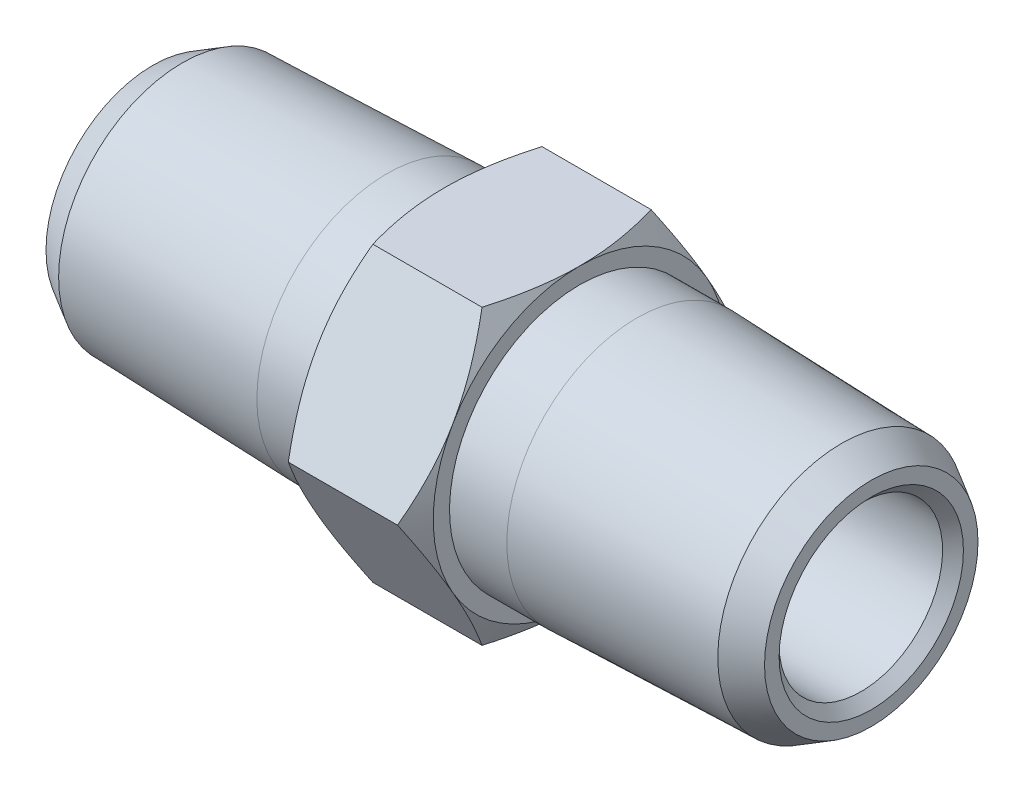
ISO-10303-21;
HEADER;
FILE_DESCRIPTION(('STEP AP214'),'2;1');
FILE_NAME('part.step','',(''),(''),'','','');
FILE_SCHEMA(('AUTOMOTIVE_DESIGN { 1 0 10303 214 1 1 1 1 }'));
ENDSEC;
DATA;
#1=APPLICATION_CONTEXT('core data for automotive mechanical design processes');
#2=APPLICATION_PROTOCOL_DEFINITION('international standard','automotive_design',2000,#1);
#3=PRODUCT_CONTEXT('',#1,'mechanical');
#4=PRODUCT('Part','Part','',(#3));
#5=PRODUCT_RELATED_PRODUCT_CATEGORY('part','',(#4));
#6=PRODUCT_DEFINITION_FORMATION('','',#4);
#7=PRODUCT_DEFINITION_CONTEXT('part definition',#1,'design');
#8=PRODUCT_DEFINITION('design','',#6,#7);
#9=PRODUCT_DEFINITION_SHAPE('','',#8);
#10=(LENGTH_UNIT() NAMED_UNIT(*) SI_UNIT(.MILLI.,.METRE.));
#11=(NAMED_UNIT(*) PLANE_ANGLE_UNIT() SI_UNIT($,.RADIAN.));
#12=(NAMED_UNIT(*) SI_UNIT($,.STERADIAN.) SOLID_ANGLE_UNIT());
#13=UNCERTAINTY_MEASURE_WITH_UNIT(LENGTH_MEASURE(1.E-05),#10,'distance_accuracy_value','');
#14=(GEOMETRIC_REPRESENTATION_CONTEXT(3) GLOBAL_UNCERTAINTY_ASSIGNED_CONTEXT((#13)) GLOBAL_UNIT_ASSIGNED_CONTEXT((#10,
#11,#12)) REPRESENTATION_CONTEXT('',''));
#15=CARTESIAN_POINT('',(0.,0.,0.));
#16=DIRECTION('',(0.,0.,1.));
#17=DIRECTION('',(1.,0.,0.));
#18=AXIS2_PLACEMENT_3D('',#15,#16,#17);
#19=CARTESIAN_POINT('',(0.,0.,-8.24889197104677));
#20=DIRECTION('',(0.,-0.5,-0.866025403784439));
#21=DIRECTION('',(0.,0.866025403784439,-0.5));
#22=AXIS2_PLACEMENT_3D('',#19,#20,#21);
#23=PLANE('',#22);
#24=CARTESIAN_POINT('',(-2.66394599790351,-2.19142867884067E-08,-8.24889195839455));
#25=CARTESIAN_POINT('',(-2.76088667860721,-0.290749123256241,-8.08102788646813));
#26=CARTESIAN_POINT('',(-2.84970126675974,-0.583826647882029,-7.911819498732));
#27=CARTESIAN_POINT('',(-3.00632419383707,-1.17256514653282,-7.57191116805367));
#28=CARTESIAN_POINT('',(-3.07423640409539,-1.46820558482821,-7.40122308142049));
#29=CARTESIAN_POINT('',(-3.15762106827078,-1.91445637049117,-7.1435800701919));
#30=CARTESIAN_POINT('',(-3.18234547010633,-2.06377034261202,-7.05737360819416));
#31=CARTESIAN_POINT('',(-3.22514392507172,-2.36311311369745,-6.88454797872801));
#32=CARTESIAN_POINT('',(-3.24321815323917,-2.51314189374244,-6.79792882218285));
#33=CARTESIAN_POINT('',(-3.27239869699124,-2.81446921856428,-6.62395741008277));
#34=CARTESIAN_POINT('',(-3.28346957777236,-2.96577035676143,-6.53660365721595));
#35=CARTESIAN_POINT('',(-3.29828555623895,-3.26867019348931,-6.36172435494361));
#36=CARTESIAN_POINT('',(-3.30202920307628,-3.42026894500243,-6.2741987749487));
#37=CARTESIAN_POINT('',(-3.30200000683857,-3.57187499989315,-6.18666897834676));
#38=B_SPLINE_CURVE_WITH_KNOTS('',3,(#24,#25,#26,#27,#28,#29,#30,#31,#32,#33,#34,#35,#36,#37),
.UNSPECIFIED.,.F.,.F.,(4,2,2,2,2,2,4),(0.,1.0487548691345,2.09221066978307,2.61462318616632,
3.1370219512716,3.66204318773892,4.18716837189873),.UNSPECIFIED.);
#39=CARTESIAN_POINT('',(-2.66394599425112,1.0957143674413E-08,-8.24889196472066));
#40=VERTEX_POINT('',#39);
#41=CARTESIAN_POINT('',(-3.30200000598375,-3.5718750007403,-6.1866689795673));
#42=VERTEX_POINT('',#41);
#43=EDGE_CURVE('E289',#40,#42,#38,.T.);
#44=ORIENTED_EDGE('',*,*,#43,.F.);
#45=DIRECTION('',(1.,0.,0.));
#46=VECTOR('',#45,1.);
#47=CARTESIAN_POINT('',(0.,0.,-8.24889197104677));
#48=LINE('',#47,#46);
#49=CARTESIAN_POINT('',(2.66394598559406,1.5014070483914E-08,-8.24889197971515));
#50=VERTEX_POINT('',#49);
#51=EDGE_CURVE('E134',#50,#40,#48,.F.);
#52=ORIENTED_EDGE('',*,*,#51,.F.);
#53=CARTESIAN_POINT('',(3.30200000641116,-3.57187499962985,-6.18666897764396));
#54=CARTESIAN_POINT('',(3.30202920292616,-3.42026894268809,-6.27419877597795));
#55=CARTESIAN_POINT('',(3.29828555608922,-3.26867018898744,-6.36172435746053));
#56=CARTESIAN_POINT('',(3.28346957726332,-2.96577034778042,-6.53660366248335));
#57=CARTESIAN_POINT('',(3.27239869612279,-2.81446920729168,-6.62395741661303));
#58=CARTESIAN_POINT('',(3.24321815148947,-2.51314187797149,-6.7979288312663));
#59=CARTESIAN_POINT('',(3.22514392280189,-2.3631130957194,-6.88454798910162));
#60=CARTESIAN_POINT('',(3.18234546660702,-2.06377032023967,-7.05737362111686));
#61=CARTESIAN_POINT('',(3.15762106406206,-1.91445634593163,-7.14358008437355));
#62=CARTESIAN_POINT('',(3.07423639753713,-1.46820555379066,-7.40122309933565));
#63=CARTESIAN_POINT('',(3.00632418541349,-1.17256511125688,-7.57191118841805));
#64=CARTESIAN_POINT('',(2.8497012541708,-0.583826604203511,-7.91181952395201));
#65=CARTESIAN_POINT('',(2.76088666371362,-0.290749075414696,-8.08102791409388));
#66=CARTESIAN_POINT('',(2.66394598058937,3.00281405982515E-08,-8.24889198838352));
#67=B_SPLINE_CURVE_WITH_KNOTS('',3,(#53,#54,#55,#56,#57,#58,#59,#60,#61,#62,#63,#64,#65,#66),
.UNSPECIFIED.,.F.,.F.,(4,2,2,2,2,2,4),(0.,0.52512519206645,1.05014643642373,1.5725452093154,
2.09495773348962,3.13841354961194,4.18716843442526),.UNSPECIFIED.);
#68=CARTESIAN_POINT('',(3.30200000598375,-3.57187500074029,-6.18666897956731));
#69=VERTEX_POINT('',#68);
#70=EDGE_CURVE('E132',#69,#50,#67,.T.);
#71=ORIENTED_EDGE('',*,*,#70,.F.);
#72=CARTESIAN_POINT('',(2.6639460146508,-7.1437499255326,-4.12444602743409));
#73=CARTESIAN_POINT('',(2.76088669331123,-6.8530008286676,-4.29231009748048));
#74=CARTESIAN_POINT('',(2.84970127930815,-6.55992330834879,-4.46151848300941));
#75=CARTESIAN_POINT('',(3.00632420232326,-5.97118481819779,-4.80142680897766));
#76=CARTESIAN_POINT('',(3.074236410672,-5.67554438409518,-4.97211489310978));
#77=CARTESIAN_POINT('',(3.15762107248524,-5.22929360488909,-5.22975790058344));
#78=CARTESIAN_POINT('',(3.18234547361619,-5.07997963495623,-5.31596436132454));
#79=CARTESIAN_POINT('',(3.22514392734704,-4.78063686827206,-5.48878998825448));
#80=CARTESIAN_POINT('',(3.24321815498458,-4.63060809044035,-5.57540914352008));
#81=CARTESIAN_POINT('',(3.27239869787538,-4.3292807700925,-5.7493805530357));
#82=CARTESIAN_POINT('',(3.28346957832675,-4.17797963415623,-5.83673430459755));
#83=CARTESIAN_POINT('',(3.29828555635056,-3.87507980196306,-6.01161360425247));
#84=CARTESIAN_POINT('',(3.30202920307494,-3.72348105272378,-6.09913918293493));
#85=CARTESIAN_POINT('',(3.30200000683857,-3.57187500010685,-6.18666897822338));
#86=B_SPLINE_CURVE_WITH_KNOTS('',3,(#72,#73,#74,#75,#76,#77,#78,#79,#80,#81,#82,#83,#84,#85),
.UNSPECIFIED.,.F.,.F.,(4,2,2,2,2,2,4),(0.,1.04875485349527,2.09221063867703,2.61462314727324,
3.13702190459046,3.66204313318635,4.18716830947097),.UNSPECIFIED.);
#87=CARTESIAN_POINT('',(2.66394598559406,-7.14375,-4.12444600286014));
#88=VERTEX_POINT('',#87);
#89=EDGE_CURVE('E20',#88,#69,#86,.T.);
#90=ORIENTED_EDGE('',*,*,#89,.F.);
#91=DIRECTION('',(1.,0.,0.));
#92=VECTOR('',#91,1.);
#93=CARTESIAN_POINT('',(0.,-7.14375,-4.12444598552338));
#94=LINE('',#93,#92);
#95=CARTESIAN_POINT('',(-2.66394600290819,-7.14374996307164,-4.12444600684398));
#96=VERTEX_POINT('',#95);
#97=EDGE_CURVE('E109',#96,#88,#94,.T.);
#98=ORIENTED_EDGE('',*,*,#97,.F.);
#99=CARTESIAN_POINT('',(-3.30200000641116,-3.57187499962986,-6.18666897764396));
#100=CARTESIAN_POINT('',(-3.30202920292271,-3.72348105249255,-6.09913918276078));
#101=CARTESIAN_POINT('',(-3.2982855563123,-3.87507980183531,-6.01161360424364));
#102=CARTESIAN_POINT('',(-3.28346957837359,-4.17797963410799,-5.83673430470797));
#103=CARTESIAN_POINT('',(-3.27239869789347,-4.32928077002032,-5.74938055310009));
#104=CARTESIAN_POINT('',(-3.24321815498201,-4.63060809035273,-5.57540914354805));
#105=CARTESIAN_POINT('',(-3.22514392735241,-4.78063686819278,-5.48878998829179));
#106=CARTESIAN_POINT('',(-3.18234547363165,-5.07997963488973,-5.31596436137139));
#107=CARTESIAN_POINT('',(-3.15762107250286,-5.22929360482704,-5.22975790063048));
#108=CARTESIAN_POINT('',(-3.07423641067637,-5.67554438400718,-4.97211489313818));
#109=CARTESIAN_POINT('',(-3.00632420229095,-5.97118481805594,-4.80142680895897));
#110=CARTESIAN_POINT('',(-2.84970127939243,-6.55992330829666,-4.4615184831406));
#111=CARTESIAN_POINT('',(-2.76088669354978,-6.85300082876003,-4.29231009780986));
#112=CARTESIAN_POINT('',(-2.66394601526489,-7.14374992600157,-4.12444602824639));
#113=B_SPLINE_CURVE_WITH_KNOTS('',3,(#99,#100,#101,#102,#103,#104,#105,#106,#107,#108,#109,#110,
#111,#112),.UNSPECIFIED.,.F.,.F.,(4,2,2,2,2,2,4),(0.,0.525125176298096,1.05014640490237,
1.5725451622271,2.09495767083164,3.13841345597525,4.1871683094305),.UNSPECIFIED.);
#114=EDGE_CURVE('E192',#42,#96,#113,.T.);
#115=ORIENTED_EDGE('',*,*,#114,.F.);
#116=EDGE_LOOP('',(#44,#52,#71,#90,#98,#115));
#117=FACE_BOUND('',#116,.T.);
#118=ADVANCED_FACE('F16',(#117),#23,.T.);
#119=CARTESIAN_POINT('',(0.,7.14375,-4.12444598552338));
#120=DIRECTION('',(0.,0.5,-0.866025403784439));
#121=DIRECTION('',(0.,0.866025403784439,0.5));
#122=AXIS2_PLACEMENT_3D('',#119,#120,#121);
#123=PLANE('',#122);
#124=CARTESIAN_POINT('',(-2.66394598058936,7.14375003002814,-4.12444596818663));
#125=CARTESIAN_POINT('',(-2.76088666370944,6.85300092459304,-4.29231004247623));
#126=CARTESIAN_POINT('',(-2.84970125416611,6.55992339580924,-4.46151843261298));
#127=CARTESIAN_POINT('',(-3.00632418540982,5.97118488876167,-4.8014267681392));
#128=CARTESIAN_POINT('',(-3.07423639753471,5.67554444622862,-4.972114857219));
#129=CARTESIAN_POINT('',(-3.15762106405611,5.2292936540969,-5.22975787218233));
#130=CARTESIAN_POINT('',(-3.1823454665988,5.07997967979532,-5.31596433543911));
#131=CARTESIAN_POINT('',(-3.22514392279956,4.78063690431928,-5.48878996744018));
#132=CARTESIAN_POINT('',(-3.24321815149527,4.6306081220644,-5.57540912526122));
#133=CARTESIAN_POINT('',(-3.27239869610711,4.32928079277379,-5.74938053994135));
#134=CARTESIAN_POINT('',(-3.28346957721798,4.17797965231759,-5.83673429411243));
#135=CARTESIAN_POINT('',(-3.29828555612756,3.87507981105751,-6.01161359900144));
#136=CARTESIAN_POINT('',(-3.302029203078,3.72348105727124,-6.09913918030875));
#137=CARTESIAN_POINT('',(-3.30200000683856,3.57187500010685,-6.18666897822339));
#138=B_SPLINE_CURVE_WITH_KNOTS('',3,(#124,#125,#126,#127,#128,#129,#130,#131,#132,#133,#134,
#135,#136,#137),.UNSPECIFIED.,.F.,.F.,(4,2,2,2,2,2,4),(0.,1.04875488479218,2.092210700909,
2.61462322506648,3.13702199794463,3.66204324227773,4.18716843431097),.UNSPECIFIED.);
#139=CARTESIAN_POINT('',(-2.66394600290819,7.14375,-4.12444594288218));
#140=VERTEX_POINT('',#139);
#141=CARTESIAN_POINT('',(-3.30200000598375,3.57187500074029,-6.18666897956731));
#142=VERTEX_POINT('',#141);
#143=EDGE_CURVE('E278',#140,#142,#138,.T.);
#144=ORIENTED_EDGE('',*,*,#143,.F.);
#145=DIRECTION('',(1.,0.,0.));
#146=VECTOR('',#145,1.);
#147=CARTESIAN_POINT('',(0.,7.14375,-4.12444598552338));
#148=LINE('',#147,#146);
#149=CARTESIAN_POINT('',(2.66394598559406,7.14375001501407,-4.124445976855));
#150=VERTEX_POINT('',#149);
#151=EDGE_CURVE('E394',#150,#140,#148,.F.);
#152=ORIENTED_EDGE('',*,*,#151,.F.);
#153=CARTESIAN_POINT('',(3.30200000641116,3.57187499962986,-6.18666897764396));
#154=CARTESIAN_POINT('',(3.30202920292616,3.7234810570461,-6.09913918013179));
#155=CARTESIAN_POINT('',(3.29828555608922,3.87507981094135,-6.01161359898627));
#156=CARTESIAN_POINT('',(3.28346957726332,4.17797965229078,-5.83673429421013));
#157=CARTESIAN_POINT('',(3.27239869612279,4.32928079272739,-5.74938053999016));
#158=CARTESIAN_POINT('',(3.24321815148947,4.63060812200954,-5.57540912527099));
#159=CARTESIAN_POINT('',(3.22514392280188,4.78063690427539,-5.48878996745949));
#160=CARTESIAN_POINT('',(3.18234546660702,5.07997967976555,-5.31596433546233));
#161=CARTESIAN_POINT('',(3.15762106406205,5.22929365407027,-5.22975787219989));
#162=CARTESIAN_POINT('',(3.07423639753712,5.67554444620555,-4.97211485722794));
#163=CARTESIAN_POINT('',(3.00632418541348,5.97118488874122,-4.80142676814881));
#164=CARTESIAN_POINT('',(2.8497012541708,6.5599233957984,-4.46151843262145));
#165=CARTESIAN_POINT('',(2.76088666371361,6.85300092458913,-4.2923100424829));
#166=CARTESIAN_POINT('',(2.66394598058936,7.14375003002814,-4.12444596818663));
#167=B_SPLINE_CURVE_WITH_KNOTS('',3,(#153,#154,#155,#156,#157,#158,#159,#160,#161,#162,#163,
#164,#165,#166),.UNSPECIFIED.,.F.,.F.,(4,2,2,2,2,2,4),(0.,0.52512519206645,1.05014643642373,
1.5725452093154,2.09495773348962,3.13841354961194,4.18716843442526),.UNSPECIFIED.);
#168=CARTESIAN_POINT('',(3.30200000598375,3.5718750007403,-6.18666897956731));
#169=VERTEX_POINT('',#168);
#170=EDGE_CURVE('E327',#169,#150,#167,.T.);
#171=ORIENTED_EDGE('',*,*,#170,.F.);
#172=CARTESIAN_POINT('',(2.6639460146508,7.35294359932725E-08,-8.24889192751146));
#173=CARTESIAN_POINT('',(2.76088669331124,0.290749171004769,-8.08102785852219));
#174=CARTESIAN_POINT('',(2.84970127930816,0.583826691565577,-7.91181947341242));
#175=CARTESIAN_POINT('',(3.00632420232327,1.17256518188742,-7.57191114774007));
#176=CARTESIAN_POINT('',(3.074236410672,1.46820561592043,-7.40122306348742));
#177=CARTESIAN_POINT('',(3.15762107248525,1.91445639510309,-7.14358005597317));
#178=CARTESIAN_POINT('',(3.18234547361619,2.06377036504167,-7.05737359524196));
#179=CARTESIAN_POINT('',(3.22514392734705,2.36311313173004,-6.88454796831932));
#180=CARTESIAN_POINT('',(3.24321815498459,2.51314190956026,-6.79792881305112));
#181=CARTESIAN_POINT('',(3.27239869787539,2.8144692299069,-6.6239574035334));
#182=CARTESIAN_POINT('',(3.28346957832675,2.96577036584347,-6.53660365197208));
#183=CARTESIAN_POINT('',(3.29828555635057,3.26867019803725,-6.36172435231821));
#184=CARTESIAN_POINT('',(3.30202920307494,3.42026894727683,-6.27419877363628));
#185=CARTESIAN_POINT('',(3.30200000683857,3.57187499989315,-6.18666897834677));
#186=B_SPLINE_CURVE_WITH_KNOTS('',3,(#172,#173,#174,#175,#176,#177,#178,#179,#180,#181,#182,
#183,#184,#185),.UNSPECIFIED.,.F.,.F.,(4,2,2,2,2,2,4),(0.,1.04875485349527,2.09221063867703,
2.61462314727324,3.13702190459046,3.66204313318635,4.18716830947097),.UNSPECIFIED.);
#187=EDGE_CURVE('E128',#50,#169,#186,.T.);
#188=ORIENTED_EDGE('',*,*,#187,.F.);
#189=ORIENTED_EDGE('',*,*,#51,.T.);
#190=CARTESIAN_POINT('',(-3.30200000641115,3.57187499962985,-6.18666897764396));
#191=CARTESIAN_POINT('',(-3.30202920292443,3.42026894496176,-6.27419877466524));
#192=CARTESIAN_POINT('',(-3.2982855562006,3.26867019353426,-6.36172435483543));
#193=CARTESIAN_POINT('',(-3.28346957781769,2.96577035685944,-6.53660365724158));
#194=CARTESIAN_POINT('',(-3.27239869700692,2.81446921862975,-6.62395741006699));
#195=CARTESIAN_POINT('',(-3.24321815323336,2.51314189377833,-6.79792882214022));
#196=CARTESIAN_POINT('',(-3.22514392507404,2.36311311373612,-6.88454797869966));
#197=CARTESIAN_POINT('',(-3.18234547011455,2.06377034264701,-7.05737360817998));
#198=CARTESIAN_POINT('',(-3.1576210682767,1.9144563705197,-7.14358007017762));
#199=CARTESIAN_POINT('',(-3.07423640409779,1.46820558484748,-7.40122308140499));
#200=CARTESIAN_POINT('',(-3.00632419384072,1.17256514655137,-7.57191116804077));
#201=CARTESIAN_POINT('',(-2.84970126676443,0.583826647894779,-7.91181949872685));
#202=CARTESIAN_POINT('',(-2.76088667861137,0.290749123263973,-8.08102788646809));
#203=CARTESIAN_POINT('',(-2.66394599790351,2.19142870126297E-08,-8.24889195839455));
#204=B_SPLINE_CURVE_WITH_KNOTS('',3,(#190,#191,#192,#193,#194,#195,#196,#197,#198,#199,#200,
#201,#202,#203),.UNSPECIFIED.,.F.,.F.,(4,2,2,2,2,2,4),(0.,0.525125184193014,1.05014642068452,
1.57254518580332,2.09495770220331,3.13841350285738,4.18716837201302),.UNSPECIFIED.);
#205=EDGE_CURVE('E293',#142,#40,#204,.T.);
#206=ORIENTED_EDGE('',*,*,#205,.F.);
#207=EDGE_LOOP('',(#144,#152,#171,#188,#189,#206));
#208=FACE_BOUND('',#207,.T.);
#209=ADVANCED_FACE('F300',(#208),#123,.T.);
#210=CARTESIAN_POINT('',(0.,7.14375,4.12444598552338));
#211=DIRECTION('',(0.,1.,0.));
#212=DIRECTION('',(0.,0.,1.));
#213=AXIS2_PLACEMENT_3D('',#210,#211,#212);
#214=PLANE('',#213);
#215=CARTESIAN_POINT('',(-2.66394601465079,7.14374999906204,4.12444590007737));
#216=CARTESIAN_POINT('',(-2.76088669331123,7.14374999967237,3.78871776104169));
#217=CARTESIAN_POINT('',(-2.84970127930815,7.14374999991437,3.45030099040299));
#218=CARTESIAN_POINT('',(-3.00632420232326,7.1437500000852,2.77048433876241));
#219=CARTESIAN_POINT('',(-3.07423641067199,7.14375000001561,2.42910817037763));
#220=CARTESIAN_POINT('',(-3.15762107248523,7.14374999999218,1.91382215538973));
#221=CARTESIAN_POINT('',(-3.18234547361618,7.14374999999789,1.74140923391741));
#222=CARTESIAN_POINT('',(-3.22514392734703,7.1437500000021,1.39575798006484));
#223=CARTESIAN_POINT('',(-3.24321815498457,7.1437500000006,1.22251966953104));
#224=CARTESIAN_POINT('',(-3.27239869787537,7.14374999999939,0.874576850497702));
#225=CARTESIAN_POINT('',(-3.28346957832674,7.1437499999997,0.699869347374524));
#226=CARTESIAN_POINT('',(-3.29828555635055,7.1437500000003,0.350110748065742));
#227=CARTESIAN_POINT('',(-3.30202920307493,7.14375000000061,0.175059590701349));
#228=CARTESIAN_POINT('',(-3.30200000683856,7.14375,1.23382771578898E-10));
#229=B_SPLINE_CURVE_WITH_KNOTS('',3,(#215,#216,#217,#218,#219,#220,#221,#222,#223,#224,#225,
#226,#227,#228),.UNSPECIFIED.,.F.,.F.,(4,2,2,2,2,2,4),(0.,1.04875485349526,2.09221063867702,
2.61462314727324,3.13702190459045,3.66204313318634,4.18716830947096),.UNSPECIFIED.);
#230=CARTESIAN_POINT('',(-2.66394598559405,7.14375001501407,4.124445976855));
#231=VERTEX_POINT('',#230);
#232=CARTESIAN_POINT('',(-3.30200000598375,7.14375000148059,0.));
#233=VERTEX_POINT('',#232);
#234=EDGE_CURVE('E258',#231,#233,#229,.T.);
#235=ORIENTED_EDGE('',*,*,#234,.F.);
#236=DIRECTION('',(1.,0.,0.));
#237=VECTOR('',#236,1.);
#238=CARTESIAN_POINT('',(0.,7.14375,4.12444598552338));
#239=LINE('',#238,#237);
#240=CARTESIAN_POINT('',(2.66394600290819,7.14375,4.12444594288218));
#241=VERTEX_POINT('',#240);
#242=EDGE_CURVE('E396',#241,#231,#239,.F.);
#243=ORIENTED_EDGE('',*,*,#242,.F.);
#244=CARTESIAN_POINT('',(3.30200000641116,7.1437499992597,0.));
#245=CARTESIAN_POINT('',(3.30202920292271,7.14374999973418,0.17505959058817));
#246=CARTESIAN_POINT('',(3.2982855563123,7.14374999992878,0.350110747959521));
#247=CARTESIAN_POINT('',(3.28346957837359,7.1437500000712,0.699869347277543));
#248=CARTESIAN_POINT('',(3.27239869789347,7.14375000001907,0.874576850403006));
#249=CARTESIAN_POINT('',(3.24321815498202,7.14374999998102,1.22251966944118));
#250=CARTESIAN_POINT('',(3.22514392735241,7.14374999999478,1.39575797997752));
#251=CARTESIAN_POINT('',(3.18234547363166,7.14375000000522,1.7414092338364));
#252=CARTESIAN_POINT('',(3.15762107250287,7.1437500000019,1.91382215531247));
#253=CARTESIAN_POINT('',(3.07423641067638,7.14374999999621,2.42910817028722));
#254=CARTESIAN_POINT('',(3.00632420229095,7.1437499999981,2.77048433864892));
#255=CARTESIAN_POINT('',(2.84970127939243,7.14375000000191,3.45030099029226));
#256=CARTESIAN_POINT('',(2.76088669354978,7.14375000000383,3.78871776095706));
#257=CARTESIAN_POINT('',(2.66394601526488,7.14375,4.12444590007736));
#258=B_SPLINE_CURVE_WITH_KNOTS('',3,(#244,#245,#246,#247,#248,#249,#250,#251,#252,#253,#254,
#255,#256,#257),.UNSPECIFIED.,.F.,.F.,(4,2,2,2,2,2,4),(0.,0.525125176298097,1.05014640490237,
1.5725451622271,2.09495767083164,3.13841345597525,4.1871683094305),.UNSPECIFIED.);
#259=CARTESIAN_POINT('',(3.30200000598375,7.14375000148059,0.));
#260=VERTEX_POINT('',#259);
#261=EDGE_CURVE('E332',#260,#241,#258,.T.);
#262=ORIENTED_EDGE('',*,*,#261,.F.);
#263=CARTESIAN_POINT('',(2.6639460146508,7.14374999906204,-4.12444590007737));
#264=CARTESIAN_POINT('',(2.76088669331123,7.14374999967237,-3.7887177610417));
#265=CARTESIAN_POINT('',(2.84970127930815,7.14374999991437,-3.450300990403));
#266=CARTESIAN_POINT('',(3.00632420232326,7.1437500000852,-2.77048433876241));
#267=CARTESIAN_POINT('',(3.074236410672,7.14375000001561,-2.42910817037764));
#268=CARTESIAN_POINT('',(3.15762107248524,7.14374999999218,-1.91382215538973));
#269=CARTESIAN_POINT('',(3.18234547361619,7.14374999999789,-1.74140923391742));
#270=CARTESIAN_POINT('',(3.22514392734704,7.1437500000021,-1.39575798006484));
#271=CARTESIAN_POINT('',(3.24321815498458,7.1437500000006,-1.22251966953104));
#272=CARTESIAN_POINT('',(3.27239869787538,7.14374999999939,-0.874576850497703));
#273=CARTESIAN_POINT('',(3.28346957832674,7.1437499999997,-0.699869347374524));
#274=CARTESIAN_POINT('',(3.29828555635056,7.1437500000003,-0.350110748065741));
#275=CARTESIAN_POINT('',(3.30202920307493,7.14375000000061,-0.175059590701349));
#276=CARTESIAN_POINT('',(3.30200000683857,7.14375,-1.23381713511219E-10));
#277=B_SPLINE_CURVE_WITH_KNOTS('',3,(#263,#264,#265,#266,#267,#268,#269,#270,#271,#272,#273,
#274,#275,#276),.UNSPECIFIED.,.F.,.F.,(4,2,2,2,2,2,4),(0.,1.04875485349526,2.09221063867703,
2.61462314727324,3.13702190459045,3.66204313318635,4.18716830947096),.UNSPECIFIED.);
#278=EDGE_CURVE('E137',#150,#260,#277,.T.);
#279=ORIENTED_EDGE('',*,*,#278,.F.);
#280=ORIENTED_EDGE('',*,*,#151,.T.);
#281=CARTESIAN_POINT('',(-3.30200000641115,7.1437499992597,0.));
#282=CARTESIAN_POINT('',(-3.30202920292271,7.14374999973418,-0.17505959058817));
#283=CARTESIAN_POINT('',(-3.29828555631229,7.14374999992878,-0.35011074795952));
#284=CARTESIAN_POINT('',(-3.28346957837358,7.1437500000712,-0.699869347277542));
#285=CARTESIAN_POINT('',(-3.27239869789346,7.14375000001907,-0.874576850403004));
#286=CARTESIAN_POINT('',(-3.24321815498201,7.14374999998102,-1.22251966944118));
#287=CARTESIAN_POINT('',(-3.2251439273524,7.14374999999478,-1.39575797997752));
#288=CARTESIAN_POINT('',(-3.18234547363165,7.14375000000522,-1.7414092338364));
#289=CARTESIAN_POINT('',(-3.15762107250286,7.1437500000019,-1.91382215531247));
#290=CARTESIAN_POINT('',(-3.07423641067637,7.14374999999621,-2.42910817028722));
#291=CARTESIAN_POINT('',(-3.00632420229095,7.1437499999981,-2.77048433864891));
#292=CARTESIAN_POINT('',(-2.84970127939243,7.14375000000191,-3.45030099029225));
#293=CARTESIAN_POINT('',(-2.76088669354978,7.14375000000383,-3.78871776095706));
#294=CARTESIAN_POINT('',(-2.66394601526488,7.14375,-4.12444590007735));
#295=B_SPLINE_CURVE_WITH_KNOTS('',3,(#281,#282,#283,#284,#285,#286,#287,#288,#289,#290,#291,
#292,#293,#294),.UNSPECIFIED.,.F.,.F.,(4,2,2,2,2,2,4),(0.,0.525125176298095,1.05014640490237,
1.5725451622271,2.09495767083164,3.13841345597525,4.1871683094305),.UNSPECIFIED.);
#296=EDGE_CURVE('E283',#233,#140,#295,.T.);
#297=ORIENTED_EDGE('',*,*,#296,.F.);
#298=EDGE_LOOP('',(#235,#243,#262,#279,#280,#297));
#299=FACE_BOUND('',#298,.T.);
#300=ADVANCED_FACE('F238',(#299),#214,.T.);
#301=CARTESIAN_POINT('',(0.,0.,8.24889197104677));
#302=DIRECTION('',(0.,0.5,0.866025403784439));
#303=DIRECTION('',(0.,-0.866025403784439,0.5));
#304=AXIS2_PLACEMENT_3D('',#301,#302,#303);
#305=PLANE('',#304);
#306=DIRECTION('',(1.,0.,0.));
#307=VECTOR('',#306,1.);
#308=CARTESIAN_POINT('',(0.,0.,8.24889197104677));
#309=LINE('',#308,#307);
#310=CARTESIAN_POINT('',(2.66394599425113,1.09571439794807E-08,8.24889196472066));
#311=VERTEX_POINT('',#310);
#312=CARTESIAN_POINT('',(-2.66394598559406,1.5014071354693E-08,8.24889197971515));
#313=VERTEX_POINT('',#312);
#314=EDGE_CURVE('E351',#311,#313,#309,.F.);
#315=ORIENTED_EDGE('',*,*,#314,.F.);
#316=CARTESIAN_POINT('',(3.30200000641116,3.57187499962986,6.18666897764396));
#317=CARTESIAN_POINT('',(3.30202920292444,3.42026894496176,6.27419877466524));
#318=CARTESIAN_POINT('',(3.29828555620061,3.26867019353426,6.36172435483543));
#319=CARTESIAN_POINT('',(3.2834695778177,2.96577035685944,6.53660365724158));
#320=CARTESIAN_POINT('',(3.27239869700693,2.81446921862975,6.62395741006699));
#321=CARTESIAN_POINT('',(3.24321815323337,2.51314189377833,6.79792882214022));
#322=CARTESIAN_POINT('',(3.22514392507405,2.36311311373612,6.88454797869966));
#323=CARTESIAN_POINT('',(3.18234547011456,2.06377034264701,7.05737360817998));
#324=CARTESIAN_POINT('',(3.15762106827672,1.9144563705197,7.14358007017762));
#325=CARTESIAN_POINT('',(3.07423640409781,1.46820558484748,7.40122308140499));
#326=CARTESIAN_POINT('',(3.00632419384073,1.17256514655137,7.57191116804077));
#327=CARTESIAN_POINT('',(2.84970126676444,0.583826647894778,7.91181949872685));
#328=CARTESIAN_POINT('',(2.76088667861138,0.290749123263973,8.08102788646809));
#329=CARTESIAN_POINT('',(2.66394599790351,2.19142863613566E-08,8.24889195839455));
#330=B_SPLINE_CURVE_WITH_KNOTS('',3,(#316,#317,#318,#319,#320,#321,#322,#323,#324,#325,#326,
#327,#328,#329),.UNSPECIFIED.,.F.,.F.,(4,2,2,2,2,2,4),(0.,0.525125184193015,1.05014642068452,
1.57254518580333,2.09495770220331,3.13841350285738,4.18716837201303),.UNSPECIFIED.);
#331=CARTESIAN_POINT('',(3.30200000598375,3.5718750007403,6.18666897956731));
#332=VERTEX_POINT('',#331);
#333=EDGE_CURVE('E224',#332,#311,#330,.T.);
#334=ORIENTED_EDGE('',*,*,#333,.F.);
#335=CARTESIAN_POINT('',(2.66394598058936,7.14375003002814,4.12444596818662));
#336=CARTESIAN_POINT('',(2.76088666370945,6.85300092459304,4.29231004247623));
#337=CARTESIAN_POINT('',(2.84970125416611,6.55992339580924,4.46151843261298));
#338=CARTESIAN_POINT('',(3.00632418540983,5.97118488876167,4.80142676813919));
#339=CARTESIAN_POINT('',(3.07423639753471,5.67554444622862,4.97211485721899));
#340=CARTESIAN_POINT('',(3.15762106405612,5.22929365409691,5.22975787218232));
#341=CARTESIAN_POINT('',(3.1823454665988,5.07997967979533,5.31596433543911));
#342=CARTESIAN_POINT('',(3.22514392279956,4.78063690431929,5.48878996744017));
#343=CARTESIAN_POINT('',(3.24321815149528,4.63060812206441,5.57540912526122));
#344=CARTESIAN_POINT('',(3.27239869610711,4.3292807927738,5.74938053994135));
#345=CARTESIAN_POINT('',(3.28346957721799,4.17797965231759,5.83673429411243));
#346=CARTESIAN_POINT('',(3.29828555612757,3.87507981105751,6.01161359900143));
#347=CARTESIAN_POINT('',(3.30202920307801,3.72348105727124,6.09913918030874));
#348=CARTESIAN_POINT('',(3.30200000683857,3.57187500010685,6.18666897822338));
#349=B_SPLINE_CURVE_WITH_KNOTS('',3,(#335,#336,#337,#338,#339,#340,#341,#342,#343,#344,#345,
#346,#347,#348),.UNSPECIFIED.,.F.,.F.,(4,2,2,2,2,2,4),(0.,1.04875488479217,2.092210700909,
2.61462322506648,3.13702199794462,3.66204324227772,4.18716843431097),.UNSPECIFIED.);
#350=EDGE_CURVE('E229',#241,#332,#349,.T.);
#351=ORIENTED_EDGE('',*,*,#350,.F.);
#352=ORIENTED_EDGE('',*,*,#242,.T.);
#353=CARTESIAN_POINT('',(-3.30200000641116,3.57187499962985,6.18666897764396));
#354=CARTESIAN_POINT('',(-3.30202920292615,3.72348105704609,6.0991391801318));
#355=CARTESIAN_POINT('',(-3.29828555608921,3.87507981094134,6.01161359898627));
#356=CARTESIAN_POINT('',(-3.28346957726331,4.17797965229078,5.83673429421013));
#357=CARTESIAN_POINT('',(-3.27239869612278,4.32928079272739,5.74938053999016));
#358=CARTESIAN_POINT('',(-3.24321815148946,4.63060812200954,5.57540912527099));
#359=CARTESIAN_POINT('',(-3.22514392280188,4.78063690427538,5.48878996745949));
#360=CARTESIAN_POINT('',(-3.18234546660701,5.07997967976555,5.31596433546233));
#361=CARTESIAN_POINT('',(-3.15762106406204,5.22929365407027,5.22975787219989));
#362=CARTESIAN_POINT('',(-3.07423639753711,5.67554444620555,4.97211485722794));
#363=CARTESIAN_POINT('',(-3.00632418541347,5.97118488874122,4.80142676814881));
#364=CARTESIAN_POINT('',(-2.84970125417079,6.5599233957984,4.46151843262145));
#365=CARTESIAN_POINT('',(-2.76088666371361,6.85300092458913,4.2923100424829));
#366=CARTESIAN_POINT('',(-2.66394598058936,7.14375003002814,4.12444596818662));
#367=B_SPLINE_CURVE_WITH_KNOTS('',3,(#353,#354,#355,#356,#357,#358,#359,#360,#361,#362,#363,
#364,#365,#366),.UNSPECIFIED.,.F.,.F.,(4,2,2,2,2,2,4),(0.,0.525125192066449,1.05014643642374,
1.5725452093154,2.09495773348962,3.13841354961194,4.18716843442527),.UNSPECIFIED.);
#368=CARTESIAN_POINT('',(-3.30200000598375,3.57187500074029,6.18666897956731));
#369=VERTEX_POINT('',#368);
#370=EDGE_CURVE('E251',#369,#231,#367,.T.);
#371=ORIENTED_EDGE('',*,*,#370,.F.);
#372=CARTESIAN_POINT('',(-2.6639460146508,7.35294386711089E-08,8.24889192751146));
#373=CARTESIAN_POINT('',(-2.76088669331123,0.290749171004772,8.08102785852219));
#374=CARTESIAN_POINT('',(-2.84970127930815,0.58382669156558,7.91181947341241));
#375=CARTESIAN_POINT('',(-3.00632420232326,1.17256518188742,7.57191114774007));
#376=CARTESIAN_POINT('',(-3.07423641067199,1.46820561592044,7.40122306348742));
#377=CARTESIAN_POINT('',(-3.15762107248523,1.9144563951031,7.14358005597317));
#378=CARTESIAN_POINT('',(-3.18234547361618,2.06377036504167,7.05737359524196));
#379=CARTESIAN_POINT('',(-3.22514392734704,2.36311313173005,6.88454796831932));
#380=CARTESIAN_POINT('',(-3.24321815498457,2.51314190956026,6.79792881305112));
#381=CARTESIAN_POINT('',(-3.27239869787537,2.8144692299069,6.6239574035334));
#382=CARTESIAN_POINT('',(-3.28346957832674,2.96577036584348,6.53660365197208));
#383=CARTESIAN_POINT('',(-3.29828555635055,3.26867019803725,6.36172435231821));
#384=CARTESIAN_POINT('',(-3.30202920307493,3.42026894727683,6.27419877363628));
#385=CARTESIAN_POINT('',(-3.30200000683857,3.57187499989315,6.18666897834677));
#386=B_SPLINE_CURVE_WITH_KNOTS('',3,(#372,#373,#374,#375,#376,#377,#378,#379,#380,#381,#382,
#383,#384,#385),.UNSPECIFIED.,.F.,.F.,(4,2,2,2,2,2,4),(0.,1.04875485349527,2.09221063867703,
2.61462314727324,3.13702190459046,3.66204313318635,4.18716830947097),.UNSPECIFIED.);
#387=EDGE_CURVE('E246',#313,#369,#386,.T.);
#388=ORIENTED_EDGE('',*,*,#387,.F.);
#389=EDGE_LOOP('',(#315,#334,#351,#352,#371,#388));
#390=FACE_BOUND('',#389,.T.);
#391=ADVANCED_FACE('F234',(#390),#305,.T.);
#392=CARTESIAN_POINT('',(0.,-7.14375,4.12444598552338));
#393=DIRECTION('',(0.,-0.5,0.866025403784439));
#394=DIRECTION('',(0.,-0.866025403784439,-0.5));
#395=AXIS2_PLACEMENT_3D('',#392,#393,#394);
#396=PLANE('',#395);
#397=DIRECTION('',(1.,0.,0.));
#398=VECTOR('',#397,1.);
#399=CARTESIAN_POINT('',(0.,-7.14375,4.12444598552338));
#400=LINE('',#399,#398);
#401=CARTESIAN_POINT('',(2.66394600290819,-7.14374996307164,4.12444600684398));
#402=VERTEX_POINT('',#401);
#403=CARTESIAN_POINT('',(-2.66394598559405,-7.14375,4.12444600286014));
#404=VERTEX_POINT('',#403);
#405=EDGE_CURVE('E120',#402,#404,#400,.F.);
#406=ORIENTED_EDGE('',*,*,#405,.F.);
#407=CARTESIAN_POINT('',(3.30200000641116,-3.57187499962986,6.18666897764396));
#408=CARTESIAN_POINT('',(3.30202920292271,-3.72348105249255,6.09913918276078));
#409=CARTESIAN_POINT('',(3.2982855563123,-3.87507980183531,6.01161360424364));
#410=CARTESIAN_POINT('',(3.28346957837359,-4.17797963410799,5.83673430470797));
#411=CARTESIAN_POINT('',(3.27239869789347,-4.32928077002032,5.74938055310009));
#412=CARTESIAN_POINT('',(3.24321815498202,-4.63060809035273,5.57540914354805));
#413=CARTESIAN_POINT('',(3.22514392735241,-4.78063686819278,5.48878998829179));
#414=CARTESIAN_POINT('',(3.18234547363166,-5.07997963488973,5.3159643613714));
#415=CARTESIAN_POINT('',(3.15762107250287,-5.22929360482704,5.22975790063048));
#416=CARTESIAN_POINT('',(3.07423641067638,-5.67554438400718,4.97211489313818));
#417=CARTESIAN_POINT('',(3.00632420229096,-5.97118481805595,4.80142680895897));
#418=CARTESIAN_POINT('',(2.84970127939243,-6.55992330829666,4.4615184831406));
#419=CARTESIAN_POINT('',(2.76088669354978,-6.85300082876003,4.29231009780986));
#420=CARTESIAN_POINT('',(2.66394601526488,-7.14374992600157,4.1244460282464));
#421=B_SPLINE_CURVE_WITH_KNOTS('',3,(#407,#408,#409,#410,#411,#412,#413,#414,#415,#416,#417,
#418,#419,#420),.UNSPECIFIED.,.F.,.F.,(4,2,2,2,2,2,4),(0.,0.525125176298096,1.05014640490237,
1.5725451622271,2.09495767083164,3.13841345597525,4.1871683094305),.UNSPECIFIED.);
#422=CARTESIAN_POINT('',(3.30200000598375,-3.5718750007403,6.18666897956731));
#423=VERTEX_POINT('',#422);
#424=EDGE_CURVE('E193',#423,#402,#421,.T.);
#425=ORIENTED_EDGE('',*,*,#424,.F.);
#426=CARTESIAN_POINT('',(2.66394599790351,-2.19142859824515E-08,8.24889195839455));
#427=CARTESIAN_POINT('',(2.76088667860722,-0.29074912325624,8.08102788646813));
#428=CARTESIAN_POINT('',(2.84970126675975,-0.583826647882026,7.91181949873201));
#429=CARTESIAN_POINT('',(3.00632419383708,-1.17256514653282,7.57191116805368));
#430=CARTESIAN_POINT('',(3.0742364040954,-1.4682055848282,7.4012230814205));
#431=CARTESIAN_POINT('',(3.15762106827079,-1.91445637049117,7.1435800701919));
#432=CARTESIAN_POINT('',(3.18234547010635,-2.06377034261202,7.05737360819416));
#433=CARTESIAN_POINT('',(3.22514392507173,-2.36311311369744,6.88454797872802));
#434=CARTESIAN_POINT('',(3.24321815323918,-2.51314189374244,6.79792882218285));
#435=CARTESIAN_POINT('',(3.27239869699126,-2.81446921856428,6.62395741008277));
#436=CARTESIAN_POINT('',(3.28346957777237,-2.96577035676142,6.53660365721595));
#437=CARTESIAN_POINT('',(3.29828555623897,-3.26867019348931,6.36172435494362));
#438=CARTESIAN_POINT('',(3.30202920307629,-3.42026894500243,6.2741987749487));
#439=CARTESIAN_POINT('',(3.30200000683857,-3.57187499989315,6.18666897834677));
#440=B_SPLINE_CURVE_WITH_KNOTS('',3,(#426,#427,#428,#429,#430,#431,#432,#433,#434,#435,#436,
#437,#438,#439),.UNSPECIFIED.,.F.,.F.,(4,2,2,2,2,2,4),(0.,1.0487548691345,2.09221066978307,
2.61462318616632,3.1370219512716,3.66204318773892,4.18716837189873),.UNSPECIFIED.);
#441=EDGE_CURVE('E219',#311,#423,#440,.T.);
#442=ORIENTED_EDGE('',*,*,#441,.F.);
#443=ORIENTED_EDGE('',*,*,#314,.T.);
#444=CARTESIAN_POINT('',(-3.30200000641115,-3.57187499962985,6.18666897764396));
#445=CARTESIAN_POINT('',(-3.30202920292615,-3.42026894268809,6.27419877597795));
#446=CARTESIAN_POINT('',(-3.29828555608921,-3.26867018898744,6.36172435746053));
#447=CARTESIAN_POINT('',(-3.28346957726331,-2.96577034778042,6.53660366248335));
#448=CARTESIAN_POINT('',(-3.27239869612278,-2.81446920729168,6.62395741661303));
#449=CARTESIAN_POINT('',(-3.24321815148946,-2.51314187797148,6.7979288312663));
#450=CARTESIAN_POINT('',(-3.22514392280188,-2.3631130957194,6.88454798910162));
#451=CARTESIAN_POINT('',(-3.18234546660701,-2.06377032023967,7.05737362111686));
#452=CARTESIAN_POINT('',(-3.15762106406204,-1.91445634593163,7.14358008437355));
#453=CARTESIAN_POINT('',(-3.07423639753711,-1.46820555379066,7.40122309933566));
#454=CARTESIAN_POINT('',(-3.00632418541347,-1.17256511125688,7.57191118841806));
#455=CARTESIAN_POINT('',(-2.84970125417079,-0.583826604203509,7.91181952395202));
#456=CARTESIAN_POINT('',(-2.76088666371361,-0.290749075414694,8.08102791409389));
#457=CARTESIAN_POINT('',(-2.66394598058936,3.00281409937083E-08,8.24889198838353));
#458=B_SPLINE_CURVE_WITH_KNOTS('',3,(#444,#445,#446,#447,#448,#449,#450,#451,#452,#453,#454,
#455,#456,#457),.UNSPECIFIED.,.F.,.F.,(4,2,2,2,2,2,4),(0.,0.525125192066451,1.05014643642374,
1.5725452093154,2.09495773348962,3.13841354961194,4.18716843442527),.UNSPECIFIED.);
#459=CARTESIAN_POINT('',(-3.30200000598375,-3.57187500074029,6.18666897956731));
#460=VERTEX_POINT('',#459);
#461=EDGE_CURVE('E687',#460,#313,#458,.T.);
#462=ORIENTED_EDGE('',*,*,#461,.F.);
#463=CARTESIAN_POINT('',(-2.66394601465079,-7.1437499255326,4.12444602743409));
#464=CARTESIAN_POINT('',(-2.76088669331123,-6.8530008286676,4.29231009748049));
#465=CARTESIAN_POINT('',(-2.84970127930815,-6.55992330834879,4.46151848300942));
#466=CARTESIAN_POINT('',(-3.00632420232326,-5.97118481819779,4.80142680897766));
#467=CARTESIAN_POINT('',(-3.07423641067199,-5.67554438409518,4.97211489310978));
#468=CARTESIAN_POINT('',(-3.15762107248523,-5.22929360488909,5.22975790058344));
#469=CARTESIAN_POINT('',(-3.18234547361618,-5.07997963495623,5.31596436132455));
#470=CARTESIAN_POINT('',(-3.22514392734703,-4.78063686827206,5.48878998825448));
#471=CARTESIAN_POINT('',(-3.24321815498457,-4.63060809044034,5.57540914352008));
#472=CARTESIAN_POINT('',(-3.27239869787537,-4.32928077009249,5.7493805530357));
#473=CARTESIAN_POINT('',(-3.28346957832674,-4.17797963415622,5.83673430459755));
#474=CARTESIAN_POINT('',(-3.29828555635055,-3.87507980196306,6.01161360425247));
#475=CARTESIAN_POINT('',(-3.30202920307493,-3.72348105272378,6.09913918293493));
#476=CARTESIAN_POINT('',(-3.30200000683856,-3.57187500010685,6.18666897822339));
#477=B_SPLINE_CURVE_WITH_KNOTS('',3,(#463,#464,#465,#466,#467,#468,#469,#470,#471,#472,#473,
#474,#475,#476),.UNSPECIFIED.,.F.,.F.,(4,2,2,2,2,2,4),(0.,1.04875485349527,2.09221063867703,
2.61462314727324,3.13702190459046,3.66204313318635,4.18716830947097),.UNSPECIFIED.);
#478=EDGE_CURVE('E40',#404,#460,#477,.T.);
#479=ORIENTED_EDGE('',*,*,#478,.F.);
#480=EDGE_LOOP('',(#406,#425,#442,#443,#462,#479));
#481=FACE_BOUND('',#480,.T.);
#482=ADVANCED_FACE('F170',(#481),#396,.T.);
#483=CARTESIAN_POINT('',(0.,-7.14375,-4.12444598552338));
#484=DIRECTION('',(0.,-1.,0.));
#485=DIRECTION('',(0.,0.,-1.));
#486=AXIS2_PLACEMENT_3D('',#483,#484,#485);
#487=PLANE('',#486);
#488=ORIENTED_EDGE('',*,*,#97,.T.);
#489=CARTESIAN_POINT('',(3.30200000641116,-7.1437499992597,0.));
#490=CARTESIAN_POINT('',(3.30202920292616,-7.14374999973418,-0.17505959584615));
#491=CARTESIAN_POINT('',(3.29828555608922,-7.14374999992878,-0.350110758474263));
#492=CARTESIAN_POINT('',(3.28346957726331,-7.1437500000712,-0.699869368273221));
#493=CARTESIAN_POINT('',(3.27239869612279,-7.14375000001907,-0.87457687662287));
#494=CARTESIAN_POINT('',(3.24321815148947,-7.14374999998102,-1.22251970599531));
#495=CARTESIAN_POINT('',(3.22514392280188,-7.14374999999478,-1.39575802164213));
#496=CARTESIAN_POINT('',(3.18234546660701,-7.14375000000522,-1.74140928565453));
#497=CARTESIAN_POINT('',(3.15762106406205,-7.1437500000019,-1.91382221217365));
#498=CARTESIAN_POINT('',(3.07423639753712,-7.14374999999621,-2.42910824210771));
#499=CARTESIAN_POINT('',(3.00632418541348,-7.1437499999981,-2.77048442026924));
#500=CARTESIAN_POINT('',(2.8497012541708,-7.14375000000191,-3.45030109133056));
#501=CARTESIAN_POINT('',(2.76088666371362,-7.14375000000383,-3.78871787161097));
#502=CARTESIAN_POINT('',(2.66394598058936,-7.14375,-4.12444602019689));
#503=B_SPLINE_CURVE_WITH_KNOTS('',3,(#489,#490,#491,#492,#493,#494,#495,#496,#497,#498,#499,
#500,#501,#502),.UNSPECIFIED.,.F.,.F.,(4,2,2,2,2,2,4),(0.,0.52512519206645,1.05014643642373,
1.5725452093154,2.09495773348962,3.13841354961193,4.18716843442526),.UNSPECIFIED.);
#504=CARTESIAN_POINT('',(3.30200000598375,-7.14375000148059,0.));
#505=VERTEX_POINT('',#504);
#506=EDGE_CURVE('E113',#505,#88,#503,.T.);
#507=ORIENTED_EDGE('',*,*,#506,.F.);
#508=CARTESIAN_POINT('',(2.66394598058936,-7.14375,4.12444602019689));
#509=CARTESIAN_POINT('',(2.76088666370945,-7.14375,3.7887178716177));
#510=CARTESIAN_POINT('',(2.84970125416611,-7.14375,3.45030109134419));
#511=CARTESIAN_POINT('',(3.00632418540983,-7.14375,2.77048442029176));
#512=CARTESIAN_POINT('',(3.07423639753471,-7.14375,2.42910824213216));
#513=CARTESIAN_POINT('',(3.15762106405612,-7.14375,1.91382221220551));
#514=CARTESIAN_POINT('',(3.1823454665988,-7.14375,1.74140928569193));
#515=CARTESIAN_POINT('',(3.22514392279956,-7.14375,1.3957580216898));
#516=CARTESIAN_POINT('',(3.24321815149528,-7.14375,1.22251970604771));
#517=CARTESIAN_POINT('',(3.27239869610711,-7.14375,0.874576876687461));
#518=CARTESIAN_POINT('',(3.28346957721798,-7.14375,0.699869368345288));
#519=CARTESIAN_POINT('',(3.29828555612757,-7.14375,0.350110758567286));
#520=CARTESIAN_POINT('',(3.302029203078,-7.14375,0.175059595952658));
#521=CARTESIAN_POINT('',(3.30200000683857,-7.14375,1.23382997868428E-10));
#522=B_SPLINE_CURVE_WITH_KNOTS('',3,(#508,#509,#510,#511,#512,#513,#514,#515,#516,#517,#518,
#519,#520,#521),.UNSPECIFIED.,.F.,.F.,(4,2,2,2,2,2,4),(0.,1.04875488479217,2.092210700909,
2.61462322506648,3.13702199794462,3.66204324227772,4.18716843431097),.UNSPECIFIED.);
#523=EDGE_CURVE('E186',#402,#505,#522,.T.);
#524=ORIENTED_EDGE('',*,*,#523,.F.);
#525=ORIENTED_EDGE('',*,*,#405,.T.);
#526=CARTESIAN_POINT('',(-3.30200000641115,-7.1437499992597,0.));
#527=CARTESIAN_POINT('',(-3.30202920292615,-7.14374999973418,0.175059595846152));
#528=CARTESIAN_POINT('',(-3.29828555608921,-7.14374999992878,0.350110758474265));
#529=CARTESIAN_POINT('',(-3.28346957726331,-7.1437500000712,0.699869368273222));
#530=CARTESIAN_POINT('',(-3.27239869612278,-7.14375000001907,0.874576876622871));
#531=CARTESIAN_POINT('',(-3.24321815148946,-7.14374999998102,1.22251970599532));
#532=CARTESIAN_POINT('',(-3.22514392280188,-7.14374999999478,1.39575802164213));
#533=CARTESIAN_POINT('',(-3.18234546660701,-7.14375000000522,1.74140928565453));
#534=CARTESIAN_POINT('',(-3.15762106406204,-7.1437500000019,1.91382221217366));
#535=CARTESIAN_POINT('',(-3.07423639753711,-7.14374999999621,2.42910824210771));
#536=CARTESIAN_POINT('',(-3.00632418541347,-7.1437499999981,2.77048442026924));
#537=CARTESIAN_POINT('',(-2.84970125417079,-7.14375000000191,3.45030109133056));
#538=CARTESIAN_POINT('',(-2.76088666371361,-7.14375000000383,3.78871787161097));
#539=CARTESIAN_POINT('',(-2.66394598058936,-7.14375,4.12444602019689));
#540=B_SPLINE_CURVE_WITH_KNOTS('',3,(#526,#527,#528,#529,#530,#531,#532,#533,#534,#535,#536,
#537,#538,#539),.UNSPECIFIED.,.F.,.F.,(4,2,2,2,2,2,4),(0.,0.525125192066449,1.05014643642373,
1.5725452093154,2.09495773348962,3.13841354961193,4.18716843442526),.UNSPECIFIED.);
#541=CARTESIAN_POINT('',(-3.30200000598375,-7.14375000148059,0.));
#542=VERTEX_POINT('',#541);
#543=EDGE_CURVE('E149',#542,#404,#540,.T.);
#544=ORIENTED_EDGE('',*,*,#543,.F.);
#545=CARTESIAN_POINT('',(-2.66394598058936,-7.14375,-4.12444602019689));
#546=CARTESIAN_POINT('',(-2.76088666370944,-7.14375,-3.7887178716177));
#547=CARTESIAN_POINT('',(-2.8497012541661,-7.14375,-3.45030109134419));
#548=CARTESIAN_POINT('',(-3.00632418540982,-7.14375,-2.77048442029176));
#549=CARTESIAN_POINT('',(-3.07423639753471,-7.14375,-2.42910824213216));
#550=CARTESIAN_POINT('',(-3.15762106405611,-7.14375,-1.91382221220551));
#551=CARTESIAN_POINT('',(-3.18234546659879,-7.14375,-1.74140928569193));
#552=CARTESIAN_POINT('',(-3.22514392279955,-7.14375,-1.3957580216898));
#553=CARTESIAN_POINT('',(-3.24321815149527,-7.14375,-1.22251970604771));
#554=CARTESIAN_POINT('',(-3.27239869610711,-7.14375,-0.87457687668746));
#555=CARTESIAN_POINT('',(-3.28346957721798,-7.14375,-0.699869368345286));
#556=CARTESIAN_POINT('',(-3.29828555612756,-7.14375,-0.350110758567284));
#557=CARTESIAN_POINT('',(-3.302029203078,-7.14375,-0.175059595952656));
#558=CARTESIAN_POINT('',(-3.30200000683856,-7.14375,-1.23381273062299E-10));
#559=B_SPLINE_CURVE_WITH_KNOTS('',3,(#545,#546,#547,#548,#549,#550,#551,#552,#553,#554,#555,
#556,#557,#558),.UNSPECIFIED.,.F.,.F.,(4,2,2,2,2,2,4),(0.,1.04875488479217,2.092210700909,
2.61462322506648,3.13702199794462,3.66204324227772,4.18716843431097),.UNSPECIFIED.);
#560=EDGE_CURVE('E116',#96,#542,#559,.T.);
#561=ORIENTED_EDGE('',*,*,#560,.F.);
#562=EDGE_LOOP('',(#488,#507,#524,#525,#544,#561));
#563=FACE_BOUND('',#562,.T.);
#564=ADVANCED_FACE('F111',(#563),#487,.T.);
#565=CARTESIAN_POINT('',(2.66011766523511,0.,0.));
#566=DIRECTION('',(-1.,0.,0.));
#567=DIRECTION('',(0.,0.,1.));
#568=AXIS2_PLACEMENT_3D('',#565,#566,#567);
#569=CONICAL_SURFACE('',#568,8.25552282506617,1.04719755);
#570=CARTESIAN_POINT('',(3.30200000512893,0.,0.));
#571=DIRECTION('',(-1.,0.,0.));
#572=DIRECTION('',(0.,0.,1.));
#573=AXIS2_PLACEMENT_3D('',#570,#571,#572);
#574=CIRCLE('',#573,7.14375000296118);
#575=EDGE_CURVE('E127',#505,#69,#574,.F.);
#576=ORIENTED_EDGE('',*,*,#575,.F.);
#577=ORIENTED_EDGE('',*,*,#506,.T.);
#578=ORIENTED_EDGE('',*,*,#89,.T.);
#579=EDGE_LOOP('',(#576,#577,#578));
#580=FACE_BOUND('',#579,.T.);
#581=ADVANCED_FACE('F125',(#580),#569,.T.);
#582=CARTESIAN_POINT('',(2.66011766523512,0.,0.));
#583=DIRECTION('',(-1.,0.,0.));
#584=DIRECTION('',(0.,0.,1.));
#585=AXIS2_PLACEMENT_3D('',#582,#583,#584);
#586=CONICAL_SURFACE('',#585,8.25552282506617,1.04719755);
#587=CARTESIAN_POINT('',(3.30200000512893,0.,0.));
#588=DIRECTION('',(-1.,0.,0.));
#589=DIRECTION('',(0.,0.,1.));
#590=AXIS2_PLACEMENT_3D('',#587,#588,#589);
#591=CIRCLE('',#590,7.14375000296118);
#592=EDGE_CURVE('E140',#69,#169,#591,.F.);
#593=ORIENTED_EDGE('',*,*,#592,.F.);
#594=ORIENTED_EDGE('',*,*,#70,.T.);
#595=ORIENTED_EDGE('',*,*,#187,.T.);
#596=EDGE_LOOP('',(#593,#594,#595));
#597=FACE_BOUND('',#596,.T.);
#598=ADVANCED_FACE('F141',(#597),#586,.T.);
#599=CARTESIAN_POINT('',(2.66011766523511,0.,0.));
#600=DIRECTION('',(-1.,0.,0.));
#601=DIRECTION('',(0.,0.,1.));
#602=AXIS2_PLACEMENT_3D('',#599,#600,#601);
#603=CONICAL_SURFACE('',#602,8.25552282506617,1.04719755);
#604=CARTESIAN_POINT('',(3.30200000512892,0.,0.));
#605=DIRECTION('',(-1.,0.,0.));
#606=DIRECTION('',(0.,0.,1.));
#607=AXIS2_PLACEMENT_3D('',#604,#605,#606);
#608=CIRCLE('',#607,7.14375000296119);
#609=EDGE_CURVE('E145',#169,#260,#608,.F.);
#610=ORIENTED_EDGE('',*,*,#609,.F.);
#611=ORIENTED_EDGE('',*,*,#170,.T.);
#612=ORIENTED_EDGE('',*,*,#278,.T.);
#613=EDGE_LOOP('',(#610,#611,#612));
#614=FACE_BOUND('',#613,.T.);
#615=ADVANCED_FACE('F321',(#614),#603,.T.);
#616=CARTESIAN_POINT('',(2.66011766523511,0.,0.));
#617=DIRECTION('',(-1.,0.,0.));
#618=DIRECTION('',(0.,0.,1.));
#619=AXIS2_PLACEMENT_3D('',#616,#617,#618);
#620=CONICAL_SURFACE('',#619,8.25552282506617,1.04719755);
#621=ORIENTED_EDGE('',*,*,#350,.T.);
#622=CARTESIAN_POINT('',(3.30200000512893,0.,0.));
#623=DIRECTION('',(-1.,0.,0.));
#624=DIRECTION('',(0.,0.,1.));
#625=AXIS2_PLACEMENT_3D('',#622,#623,#624);
#626=CIRCLE('',#625,7.14375000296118);
#627=EDGE_CURVE('E147',#260,#332,#626,.F.);
#628=ORIENTED_EDGE('',*,*,#627,.F.);
#629=ORIENTED_EDGE('',*,*,#261,.T.);
#630=EDGE_LOOP('',(#621,#628,#629));
#631=FACE_BOUND('',#630,.T.);
#632=ADVANCED_FACE('F214',(#631),#620,.T.);
#633=CARTESIAN_POINT('',(2.66011766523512,0.,0.));
#634=DIRECTION('',(-1.,0.,0.));
#635=DIRECTION('',(0.,0.,1.));
#636=AXIS2_PLACEMENT_3D('',#633,#634,#635);
#637=CONICAL_SURFACE('',#636,8.25552282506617,1.04719755);
#638=ORIENTED_EDGE('',*,*,#441,.T.);
#639=CARTESIAN_POINT('',(3.30200000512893,0.,0.));
#640=DIRECTION('',(-1.,0.,0.));
#641=DIRECTION('',(0.,0.,1.));
#642=AXIS2_PLACEMENT_3D('',#639,#640,#641);
#643=CIRCLE('',#642,7.14375000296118);
#644=EDGE_CURVE('E346',#332,#423,#643,.F.);
#645=ORIENTED_EDGE('',*,*,#644,.F.);
#646=ORIENTED_EDGE('',*,*,#333,.T.);
#647=EDGE_LOOP('',(#638,#645,#646));
#648=FACE_BOUND('',#647,.T.);
#649=ADVANCED_FACE('F206',(#648),#637,.T.);
#650=CARTESIAN_POINT('',(2.66011766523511,0.,0.));
#651=DIRECTION('',(-1.,0.,0.));
#652=DIRECTION('',(0.,0.,1.));
#653=AXIS2_PLACEMENT_3D('',#650,#651,#652);
#654=CONICAL_SURFACE('',#653,8.25552282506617,1.04719755);
#655=ORIENTED_EDGE('',*,*,#523,.T.);
#656=CARTESIAN_POINT('',(3.30200000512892,0.,0.));
#657=DIRECTION('',(-1.,0.,0.));
#658=DIRECTION('',(0.,0.,1.));
#659=AXIS2_PLACEMENT_3D('',#656,#657,#658);
#660=CIRCLE('',#659,7.14375000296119);
#661=EDGE_CURVE('E353',#423,#505,#660,.F.);
#662=ORIENTED_EDGE('',*,*,#661,.F.);
#663=ORIENTED_EDGE('',*,*,#424,.T.);
#664=EDGE_LOOP('',(#655,#662,#663));
#665=FACE_BOUND('',#664,.T.);
#666=ADVANCED_FACE('F201',(#665),#654,.T.);
#667=CARTESIAN_POINT('',(-2.6601176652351,0.,0.));
#668=DIRECTION('',(1.,0.,0.));
#669=DIRECTION('',(0.,0.,-1.));
#670=AXIS2_PLACEMENT_3D('',#667,#668,#669);
#671=CONICAL_SURFACE('',#670,8.25552282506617,1.04719755);
#672=ORIENTED_EDGE('',*,*,#560,.T.);
#673=CARTESIAN_POINT('',(-3.30200000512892,0.,0.));
#674=DIRECTION('',(1.,0.,0.));
#675=DIRECTION('',(0.,0.,-1.));
#676=AXIS2_PLACEMENT_3D('',#673,#674,#675);
#677=CIRCLE('',#676,7.14375000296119);
#678=EDGE_CURVE('E355',#542,#42,#677,.T.);
#679=ORIENTED_EDGE('',*,*,#678,.T.);
#680=ORIENTED_EDGE('',*,*,#114,.T.);
#681=EDGE_LOOP('',(#672,#679,#680));
#682=FACE_BOUND('',#681,.T.);
#683=ADVANCED_FACE('F205',(#682),#671,.T.);
#684=CARTESIAN_POINT('',(-2.66011766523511,0.,0.));
#685=DIRECTION('',(1.,0.,0.));
#686=DIRECTION('',(0.,0.,-1.));
#687=AXIS2_PLACEMENT_3D('',#684,#685,#686);
#688=CONICAL_SURFACE('',#687,8.25552282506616,1.04719755);
#689=ORIENTED_EDGE('',*,*,#43,.T.);
#690=CARTESIAN_POINT('',(-3.30200000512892,0.,0.));
#691=DIRECTION('',(1.,0.,0.));
#692=DIRECTION('',(0.,0.,-1.));
#693=AXIS2_PLACEMENT_3D('',#690,#691,#692);
#694=CIRCLE('',#693,7.14375000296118);
#695=EDGE_CURVE('E360',#42,#142,#694,.T.);
#696=ORIENTED_EDGE('',*,*,#695,.T.);
#697=ORIENTED_EDGE('',*,*,#205,.T.);
#698=EDGE_LOOP('',(#689,#696,#697));
#699=FACE_BOUND('',#698,.T.);
#700=ADVANCED_FACE('F274',(#699),#688,.T.);
#701=CARTESIAN_POINT('',(-2.6601176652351,0.,0.));
#702=DIRECTION('',(1.,0.,0.));
#703=DIRECTION('',(0.,0.,-1.));
#704=AXIS2_PLACEMENT_3D('',#701,#702,#703);
#705=CONICAL_SURFACE('',#704,8.25552282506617,1.04719755);
#706=ORIENTED_EDGE('',*,*,#143,.T.);
#707=CARTESIAN_POINT('',(-3.30200000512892,0.,0.));
#708=DIRECTION('',(1.,0.,0.));
#709=DIRECTION('',(0.,0.,-1.));
#710=AXIS2_PLACEMENT_3D('',#707,#708,#709);
#711=CIRCLE('',#710,7.14375000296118);
#712=EDGE_CURVE('E363',#142,#233,#711,.T.);
#713=ORIENTED_EDGE('',*,*,#712,.T.);
#714=ORIENTED_EDGE('',*,*,#296,.T.);
#715=EDGE_LOOP('',(#706,#713,#714));
#716=FACE_BOUND('',#715,.T.);
#717=ADVANCED_FACE('F268',(#716),#705,.T.);
#718=CARTESIAN_POINT('',(-2.6601176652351,0.,0.));
#719=DIRECTION('',(1.,0.,0.));
#720=DIRECTION('',(0.,0.,-1.));
#721=AXIS2_PLACEMENT_3D('',#718,#719,#720);
#722=CONICAL_SURFACE('',#721,8.25552282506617,1.04719755);
#723=CARTESIAN_POINT('',(-3.30200000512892,0.,0.));
#724=DIRECTION('',(1.,0.,0.));
#725=DIRECTION('',(0.,0.,-1.));
#726=AXIS2_PLACEMENT_3D('',#723,#724,#725);
#727=CIRCLE('',#726,7.14375000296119);
#728=EDGE_CURVE('E366',#233,#369,#727,.T.);
#729=ORIENTED_EDGE('',*,*,#728,.T.);
#730=ORIENTED_EDGE('',*,*,#370,.T.);
#731=ORIENTED_EDGE('',*,*,#234,.T.);
#732=EDGE_LOOP('',(#729,#730,#731));
#733=FACE_BOUND('',#732,.T.);
#734=ADVANCED_FACE('F263',(#733),#722,.T.);
#735=CARTESIAN_POINT('',(-2.66011766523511,0.,0.));
#736=DIRECTION('',(1.,0.,0.));
#737=DIRECTION('',(0.,0.,-1.));
#738=AXIS2_PLACEMENT_3D('',#735,#736,#737);
#739=CONICAL_SURFACE('',#738,8.25552282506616,1.04719755);
#740=CARTESIAN_POINT('',(-3.30200000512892,0.,0.));
#741=DIRECTION('',(1.,0.,0.));
#742=DIRECTION('',(0.,0.,-1.));
#743=AXIS2_PLACEMENT_3D('',#740,#741,#742);
#744=CIRCLE('',#743,7.14375000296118);
#745=EDGE_CURVE('E369',#369,#460,#744,.T.);
#746=ORIENTED_EDGE('',*,*,#745,.T.);
#747=ORIENTED_EDGE('',*,*,#461,.T.);
#748=ORIENTED_EDGE('',*,*,#387,.T.);
#749=EDGE_LOOP('',(#746,#747,#748));
#750=FACE_BOUND('',#749,.T.);
#751=ADVANCED_FACE('F267',(#750),#739,.T.);
#752=CARTESIAN_POINT('',(-2.6601176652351,0.,0.));
#753=DIRECTION('',(1.,0.,0.));
#754=DIRECTION('',(0.,0.,-1.));
#755=AXIS2_PLACEMENT_3D('',#752,#753,#754);
#756=CONICAL_SURFACE('',#755,8.25552282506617,1.04719755);
#757=CARTESIAN_POINT('',(-3.30200000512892,0.,0.));
#758=DIRECTION('',(1.,0.,0.));
#759=DIRECTION('',(0.,0.,-1.));
#760=AXIS2_PLACEMENT_3D('',#757,#758,#759);
#761=CIRCLE('',#760,7.14375000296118);
#762=EDGE_CURVE('E372',#460,#542,#761,.T.);
#763=ORIENTED_EDGE('',*,*,#762,.T.);
#764=ORIENTED_EDGE('',*,*,#543,.T.);
#765=ORIENTED_EDGE('',*,*,#478,.T.);
#766=EDGE_LOOP('',(#763,#764,#765));
#767=FACE_BOUND('',#766,.T.);
#768=ADVANCED_FACE('F164',(#767),#756,.T.);
#769=CARTESIAN_POINT('',(3.302,0.,0.));
#770=DIRECTION('',(1.,0.,0.));
#771=DIRECTION('',(0.,0.,-1.));
#772=AXIS2_PLACEMENT_3D('',#769,#770,#771);
#773=PLANE('',#772);
#774=CARTESIAN_POINT('',(3.302,0.,0.));
#775=DIRECTION('',(1.,0.,0.));
#776=DIRECTION('',(0.,1.,0.));
#777=AXIS2_PLACEMENT_3D('',#774,#775,#776);
#778=CIRCLE('',#777,6.35);
#779=CARTESIAN_POINT('',(3.302,6.35,0.));
#780=VERTEX_POINT('',#779);
#781=EDGE_CURVE('E374',#780,#780,#778,.T.);
#782=ORIENTED_EDGE('',*,*,#781,.F.);
#783=EDGE_LOOP('',(#782));
#784=FACE_BOUND('',#783,.T.);
#785=ORIENTED_EDGE('',*,*,#644,.T.);
#786=ORIENTED_EDGE('',*,*,#661,.T.);
#787=ORIENTED_EDGE('',*,*,#575,.T.);
#788=ORIENTED_EDGE('',*,*,#592,.T.);
#789=ORIENTED_EDGE('',*,*,#609,.T.);
#790=ORIENTED_EDGE('',*,*,#627,.T.);
#791=EDGE_LOOP('',(#785,#786,#787,#788,#789,#790));
#792=FACE_BOUND('',#791,.T.);
#793=ADVANCED_FACE('F344',(#784,#792),#773,.T.);
#794=CARTESIAN_POINT('',(-3.302,0.,0.));
#795=DIRECTION('',(1.,0.,0.));
#796=DIRECTION('',(0.,0.,-1.));
#797=AXIS2_PLACEMENT_3D('',#794,#795,#796);
#798=PLANE('',#797);
#799=CARTESIAN_POINT('',(-3.302,0.,0.));
#800=DIRECTION('',(-1.,0.,0.));
#801=DIRECTION('',(0.,0.,1.));
#802=AXIS2_PLACEMENT_3D('',#799,#800,#801);
#803=CIRCLE('',#802,6.35);
#804=CARTESIAN_POINT('',(-3.302,0.,6.35));
#805=VERTEX_POINT('',#804);
#806=EDGE_CURVE('E377',#805,#805,#803,.T.);
#807=ORIENTED_EDGE('',*,*,#806,.F.);
#808=EDGE_LOOP('',(#807));
#809=FACE_BOUND('',#808,.T.);
#810=ORIENTED_EDGE('',*,*,#745,.F.);
#811=ORIENTED_EDGE('',*,*,#728,.F.);
#812=ORIENTED_EDGE('',*,*,#712,.F.);
#813=ORIENTED_EDGE('',*,*,#695,.F.);
#814=ORIENTED_EDGE('',*,*,#678,.F.);
#815=ORIENTED_EDGE('',*,*,#762,.F.);
#816=EDGE_LOOP('',(#810,#811,#812,#813,#814,#815));
#817=FACE_BOUND('',#816,.T.);
#818=ADVANCED_FACE('F426',(#809,#817),#798,.F.);
#819=CARTESIAN_POINT('',(4.699,0.,0.));
#820=DIRECTION('',(1.,0.,0.));
#821=DIRECTION('',(0.,1.,0.));
#822=AXIS2_PLACEMENT_3D('',#819,#820,#821);
#823=CYLINDRICAL_SURFACE('',#822,6.35);
#824=ORIENTED_EDGE('',*,*,#781,.T.);
#825=EDGE_LOOP('',(#824));
#826=FACE_BOUND('',#825,.T.);
#827=CARTESIAN_POINT('',(6.09600000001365,0.,0.));
#828=DIRECTION('',(-1.,0.,0.));
#829=DIRECTION('',(0.,1.,0.));
#830=AXIS2_PLACEMENT_3D('',#827,#828,#829);
#831=CIRCLE('',#830,6.34999999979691);
#832=CARTESIAN_POINT('',(6.09600000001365,6.34999999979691,0.));
#833=VERTEX_POINT('',#832);
#834=EDGE_CURVE('E380',#833,#833,#831,.F.);
#835=ORIENTED_EDGE('',*,*,#834,.F.);
#836=EDGE_LOOP('',(#835));
#837=FACE_BOUND('',#836,.T.);
#838=ADVANCED_FACE('F423',(#826,#837),#823,.T.);
#839=CARTESIAN_POINT('',(-3.302,0.,0.));
#840=DIRECTION('',(-1.,0.,0.));
#841=DIRECTION('',(0.,0.,1.));
#842=AXIS2_PLACEMENT_3D('',#839,#840,#841);
#843=CYLINDRICAL_SURFACE('',#842,6.35);
#844=CARTESIAN_POINT('',(-6.096,0.,0.));
#845=DIRECTION('',(-1.,0.,0.));
#846=DIRECTION('',(0.,0.,1.));
#847=AXIS2_PLACEMENT_3D('',#844,#845,#846);
#848=CIRCLE('',#847,6.35);
#849=CARTESIAN_POINT('',(-6.096,0.,6.35));
#850=VERTEX_POINT('',#849);
#851=EDGE_CURVE('E403',#850,#850,#848,.T.);
#852=ORIENTED_EDGE('',*,*,#851,.F.);
#853=EDGE_LOOP('',(#852));
#854=FACE_BOUND('',#853,.T.);
#855=ORIENTED_EDGE('',*,*,#806,.T.);
#856=EDGE_LOOP('',(#855));
#857=FACE_BOUND('',#856,.T.);
#858=ADVANCED_FACE('F302',(#854,#857),#843,.T.);
#859=CARTESIAN_POINT('',(6.09600000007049,0.,0.));
#860=DIRECTION('',(-1.,0.,0.));
#861=DIRECTION('',(0.,-1.,0.));
#862=AXIS2_PLACEMENT_3D('',#859,#860,#861);
#863=CONICAL_SURFACE('',#862,6.34999999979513,0.0311192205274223);
#864=ORIENTED_EDGE('',*,*,#834,.T.);
#865=EDGE_LOOP('',(#864));
#866=FACE_BOUND('',#865,.T.);
#867=CARTESIAN_POINT('',(16.0781999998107,0.,0.));
#868=DIRECTION('',(-1.,0.,0.));
#869=DIRECTION('',(0.,0.,1.));
#870=AXIS2_PLACEMENT_3D('',#867,#868,#869);
#871=CIRCLE('',#870,6.03926140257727);
#872=CARTESIAN_POINT('',(16.0781999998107,0.,6.03926140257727));
#873=VERTEX_POINT('',#872);
#874=EDGE_CURVE('E406',#873,#873,#871,.F.);
#875=ORIENTED_EDGE('',*,*,#874,.F.);
#876=EDGE_LOOP('',(#875));
#877=FACE_BOUND('',#876,.T.);
#878=ADVANCED_FACE('F418',(#866,#877),#863,.T.);
#879=CARTESIAN_POINT('',(-6.096,0.,0.));
#880=DIRECTION('',(1.,0.,0.));
#881=DIRECTION('',(0.,0.,-1.));
#882=AXIS2_PLACEMENT_3D('',#879,#880,#881);
#883=CONICAL_SURFACE('',#882,6.35,0.0311192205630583);
#884=CARTESIAN_POINT('',(-16.0781999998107,0.,0.));
#885=DIRECTION('',(1.,0.,0.));
#886=DIRECTION('',(0.,0.,1.));
#887=AXIS2_PLACEMENT_3D('',#884,#885,#886);
#888=CIRCLE('',#887,6.03926140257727);
#889=CARTESIAN_POINT('',(-16.0781999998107,0.,6.03926140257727));
#890=VERTEX_POINT('',#889);
#891=EDGE_CURVE('E385',#890,#890,#888,.F.);
#892=ORIENTED_EDGE('',*,*,#891,.F.);
#893=EDGE_LOOP('',(#892));
#894=FACE_BOUND('',#893,.T.);
#895=ORIENTED_EDGE('',*,*,#851,.T.);
#896=EDGE_LOOP('',(#895));
#897=FACE_BOUND('',#896,.T.);
#898=ADVANCED_FACE('F414',(#894,#897),#883,.T.);
#899=CARTESIAN_POINT('',(16.0781999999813,0.,0.));
#900=DIRECTION('',(-1.,0.,0.));
#901=DIRECTION('',(0.,0.,1.));
#902=AXIS2_PLACEMENT_3D('',#899,#900,#901);
#903=CONICAL_SURFACE('',#902,6.03926140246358,0.521718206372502);
#904=CARTESIAN_POINT('',(17.5260000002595,0.,0.));
#905=DIRECTION('',(-1.,0.,0.));
#906=DIRECTION('',(0.,0.,1.));
#907=AXIS2_PLACEMENT_3D('',#904,#905,#906);
#908=CIRCLE('',#907,5.207000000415);
#909=CARTESIAN_POINT('',(17.5260000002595,0.,5.207000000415));
#910=VERTEX_POINT('',#909);
#911=EDGE_CURVE('E381',#910,#910,#908,.F.);
#912=ORIENTED_EDGE('',*,*,#911,.F.);
#913=EDGE_LOOP('',(#912));
#914=FACE_BOUND('',#913,.T.);
#915=ORIENTED_EDGE('',*,*,#874,.T.);
#916=EDGE_LOOP('',(#915));
#917=FACE_BOUND('',#916,.T.);
#918=ADVANCED_FACE('F417',(#914,#917),#903,.T.);
#919=CARTESIAN_POINT('',(-16.0781999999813,0.,0.));
#920=DIRECTION('',(1.,0.,0.));
#921=DIRECTION('',(0.,0.,-1.));
#922=AXIS2_PLACEMENT_3D('',#919,#920,#921);
#923=CONICAL_SURFACE('',#922,6.03926140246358,0.521718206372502);
#924=CARTESIAN_POINT('',(-17.5260000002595,0.,0.));
#925=DIRECTION('',(1.,0.,0.));
#926=DIRECTION('',(0.,0.,-1.));
#927=AXIS2_PLACEMENT_3D('',#924,#925,#926);
#928=CIRCLE('',#927,5.207000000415);
#929=CARTESIAN_POINT('',(-17.5260000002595,0.,-5.207000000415));
#930=VERTEX_POINT('',#929);
#931=EDGE_CURVE('E384',#930,#930,#928,.F.);
#932=ORIENTED_EDGE('',*,*,#931,.F.);
#933=EDGE_LOOP('',(#932));
#934=FACE_BOUND('',#933,.T.);
#935=ORIENTED_EDGE('',*,*,#891,.T.);
#936=EDGE_LOOP('',(#935));
#937=FACE_BOUND('',#936,.T.);
#938=ADVANCED_FACE('F412',(#934,#937),#923,.T.);
#939=CARTESIAN_POINT('',(17.526,2.99709622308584,0.));
#940=DIRECTION('',(1.,0.,0.));
#941=DIRECTION('',(0.,0.,-1.));
#942=AXIS2_PLACEMENT_3D('',#939,#940,#941);
#943=PLANE('',#942);
#944=CARTESIAN_POINT('',(17.5260000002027,0.,0.));
#945=DIRECTION('',(1.,0.,0.));
#946=DIRECTION('',(0.,1.,0.));
#947=AXIS2_PLACEMENT_3D('',#944,#945,#946);
#948=CIRCLE('',#947,4.49579999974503);
#949=CARTESIAN_POINT('',(17.5260000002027,4.49579999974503,0.));
#950=VERTEX_POINT('',#949);
#951=EDGE_CURVE('E388',#950,#950,#948,.F.);
#952=ORIENTED_EDGE('',*,*,#951,.T.);
#953=EDGE_LOOP('',(#952));
#954=FACE_BOUND('',#953,.T.);
#955=ORIENTED_EDGE('',*,*,#911,.T.);
#956=EDGE_LOOP('',(#955));
#957=FACE_BOUND('',#956,.T.);
#958=ADVANCED_FACE('F474',(#954,#957),#943,.T.);
#959=CARTESIAN_POINT('',(-17.526,5.31114,5.207));
#960=DIRECTION('',(-1.,0.,0.));
#961=DIRECTION('',(0.,0.,-1.));
#962=AXIS2_PLACEMENT_3D('',#959,#960,#961);
#963=PLANE('',#962);
#964=CARTESIAN_POINT('',(-17.526,0.,0.));
#965=DIRECTION('',(-1.,0.,0.));
#966=DIRECTION('',(0.,0.,1.));
#967=AXIS2_PLACEMENT_3D('',#964,#965,#966);
#968=CIRCLE('',#967,3.9878);
#969=CARTESIAN_POINT('',(-17.526,0.,3.9878));
#970=VERTEX_POINT('',#969);
#971=EDGE_CURVE('E31',#970,#970,#968,.F.);
#972=ORIENTED_EDGE('',*,*,#971,.T.);
#973=EDGE_LOOP('',(#972));
#974=FACE_BOUND('',#973,.T.);
#975=ORIENTED_EDGE('',*,*,#931,.T.);
#976=EDGE_LOOP('',(#975));
#977=FACE_BOUND('',#976,.T.);
#978=ADVANCED_FACE('F465',(#974,#977),#963,.T.);
#979=CARTESIAN_POINT('',(17.5260000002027,0.,0.));
#980=DIRECTION('',(1.,0.,0.));
#981=DIRECTION('',(0.,1.,0.));
#982=AXIS2_PLACEMENT_3D('',#979,#980,#981);
#983=CONICAL_SURFACE('',#982,4.49579999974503,0.785398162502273);
#984=CARTESIAN_POINT('',(17.018,0.,0.));
#985=DIRECTION('',(-1.,0.,0.));
#986=DIRECTION('',(0.,0.,1.));
#987=AXIS2_PLACEMENT_3D('',#984,#985,#986);
#988=CIRCLE('',#987,3.9878);
#989=CARTESIAN_POINT('',(17.018,0.,3.9878));
#990=VERTEX_POINT('',#989);
#991=EDGE_CURVE('E11',#990,#990,#988,.T.);
#992=ORIENTED_EDGE('',*,*,#991,.T.);
#993=EDGE_LOOP('',(#992));
#994=FACE_BOUND('',#993,.T.);
#995=ORIENTED_EDGE('',*,*,#951,.F.);
#996=EDGE_LOOP('',(#995));
#997=FACE_BOUND('',#996,.T.);
#998=ADVANCED_FACE('F459',(#994,#997),#983,.F.);
#999=CARTESIAN_POINT('',(17.018,0.,0.));
#1000=DIRECTION('',(-1.,0.,0.));
#1001=DIRECTION('',(0.,0.,1.));
#1002=AXIS2_PLACEMENT_3D('',#999,#1000,#1001);
#1003=CYLINDRICAL_SURFACE('',#1002,3.9878);
#1004=ORIENTED_EDGE('',*,*,#991,.F.);
#1005=EDGE_LOOP('',(#1004));
#1006=FACE_BOUND('',#1005,.T.);
#1007=ORIENTED_EDGE('',*,*,#971,.F.);
#1008=EDGE_LOOP('',(#1007));
#1009=FACE_BOUND('',#1008,.T.);
#1010=ADVANCED_FACE('F18',(#1006,#1009),#1003,.F.);
#1011=CLOSED_SHELL('',(#118,#209,#300,#391,#482,#564,#581,#598,#615,#632,#649,#666,#683,#700,
#717,#734,#751,#768,#793,#818,#838,#858,#878,#898,#918,#938,#958,#978,#998,#1010));
#1012=MANIFOLD_SOLID_BREP('B1',#1011);
#1013=ADVANCED_BREP_SHAPE_REPRESENTATION('',(#18,#1012),#14);
#1014=SHAPE_DEFINITION_REPRESENTATION(#9,#1013);
ENDSEC;
END-ISO-10303-21;
